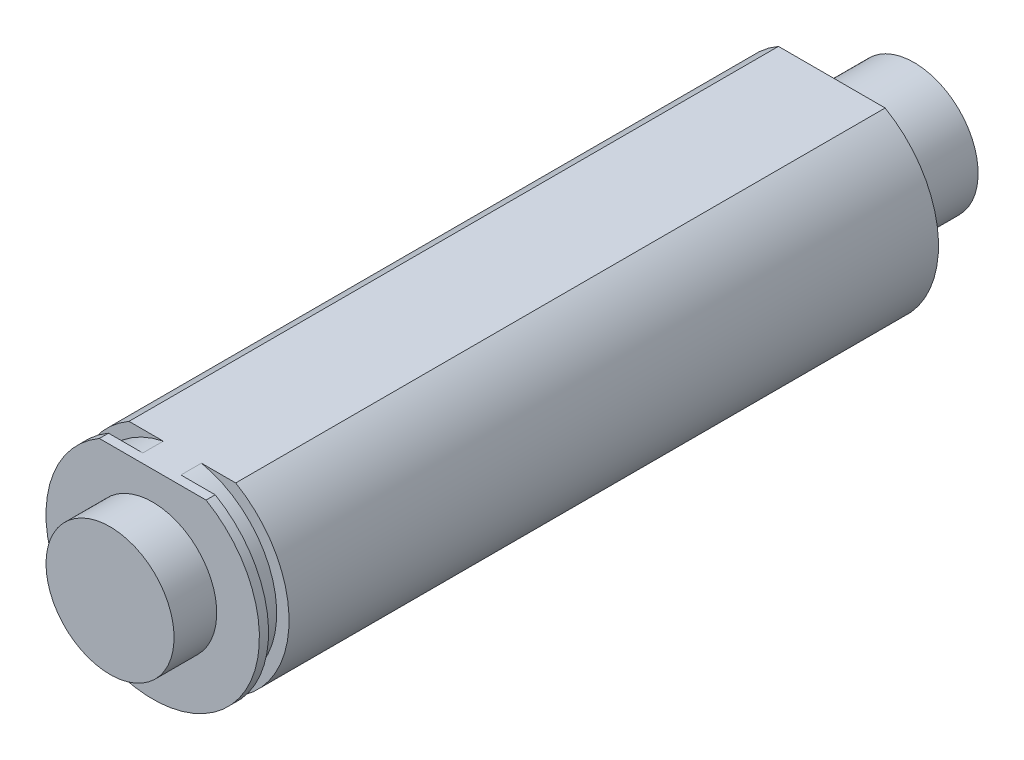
from build123d import *

# Parameters (mm, degrees)
BOSS_EXTRUDE2_DEPTH      = 152.4
BOSS_EXTRUDE2_DEPTH_BACK = 152.4
SKETCH3_R                = 7.9375
CUT_EXTRUDE5_DEPTH       = 153.812852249
CUT_EXTRUDE5_DEPTH_BACK  = 153.812852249
CHAMFER1_SIZE            = 0.79375
SKETCH16_W               = 48.636348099
SKETCH16_H               = 31.933787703
CUT_EXTRUDE7_DEPTH       = 154.3236665
SKETCH17_W               = 30.521487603
SKETCH17_H               = 19.545780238
SKETCH17_R               = 4.7625
CUT_EXTRUDE8_DEPTH       = 3.5814
SKETCH18_W               = 0.918669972
SKETCH18_H               = 1.524
BOSS_EXTRUDE3_START      = 2.54
SKETCH19_R               = 4.7625
BOSS_EXTRUDE3_DEPTH      = 2.54


with BuildPart() as part:
    # Sketch3 → Boss-Extrude2 (new, two sides: drawn at the far end of the back side and taken through both)
    with BuildSketch(Plane.XY.offset(-BOSS_EXTRUDE2_DEPTH_BACK)):
        with Locations(Location((0, 0, 0), (0, 0, 180))):
            Circle(SKETCH3_R)
    extrude(amount=BOSS_EXTRUDE2_DEPTH + BOSS_EXTRUDE2_DEPTH_BACK)

    # Sketch10 → Cut-Extrude5 (cut, two sides: drawn at the far end of the back side and taken through both)
    with BuildSketch(Plane.XY.offset(-CUT_EXTRUDE5_DEPTH_BACK)):
        with BuildLine():
            Line((-3.96875, 6.874076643), (3.96875, 6.874076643))
            ThreePointArc((3.96875, 6.874076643), (0, 7.9375), (-3.96875, 6.874076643))
        make_face()
    extrude(amount=CUT_EXTRUDE5_DEPTH + CUT_EXTRUDE5_DEPTH_BACK, mode=Mode.SUBTRACT)

    # Chamfer1
    chamfer1_edges = [part.edges().sort_by_distance(p)[0] for p in [
        (0, -7.9375, -152.4),
        (0, -7.9375, 152.4),
    ]]
    chamfer(chamfer1_edges, length=CHAMFER1_SIZE)

    # Sketch15 → Cut-Revolve1 (revolve, cut)
    with BuildSketch(Plane(origin=(0, 0, 0), x_dir=(1, 0, 0), z_dir=(0, 1, 0))):
        Polygon((-7.9375, -152.4), (0, -152.4), (0, 82.882548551), (-4.7625, 82.882548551), (-4.7625, 86.057548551), (-7.9375, 86.057548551), align=None)
    revolve(axis=Axis((0, 0, 0), (0, 0, 1)), mode=Mode.SUBTRACT)

    # Sketch16 → Cut-Extrude7 (cut, through all)
    with BuildSketch(Plane(origin=(0, 6.874076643, 0), x_dir=(1, 0, 0), z_dir=(0, 1, 0))):
        with Locations((-0.042323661, 156.120495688)):
            Rectangle(SKETCH16_W, SKETCH16_H)
    extrude(amount=-CUT_EXTRUDE7_DEPTH, mode=Mode.SUBTRACT)

    # Sketch17 → Cut-Extrude8 (cut)
    with BuildSketch(Plane(origin=(0, 0, -140.153601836), x_dir=(-1, 0, 0), z_dir=(0, 0, -1))):
        with Locations((2.10493018, -0.822238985)):
            Rectangle(SKETCH17_W, SKETCH17_H)
        Circle(SKETCH17_R, mode=Mode.SUBTRACT)
    extrude(amount=-CUT_EXTRUDE8_DEPTH, mode=Mode.SUBTRACT)

    # Sketch18 → Cut-Revolve2 (revolve, cut)
    with BuildSketch(Plane(origin=(0, 0, 0), x_dir=(1, 0, 0), z_dir=(0, 1, 0))):
        with Locations((-7.478165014, 87.499902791)):
            Rectangle(SKETCH18_W, SKETCH18_H)
    revolve(axis=Axis((0, 0, -83.930701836), (0, 0, -1)), mode=Mode.SUBTRACT)

    # Sketch19 → Boss-Extrude3 (add)
    with BuildSketch(Plane(origin=(0, 0, -140.153601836), x_dir=(-1, 0, 0), z_dir=(0, 0, -1)).offset(BOSS_EXTRUDE3_START)):
        Circle(SKETCH19_R)
    extrude(amount=-BOSS_EXTRUDE3_DEPTH)


solid = part.part
